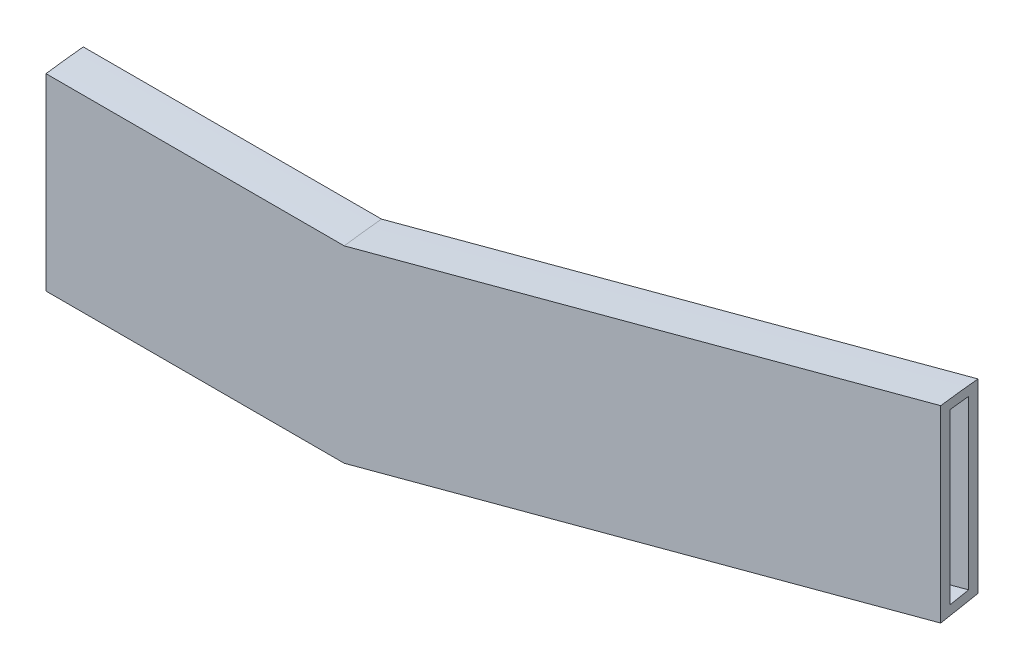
ISO-10303-21;
HEADER;
FILE_DESCRIPTION(('STEP AP214'),'2;1');
FILE_NAME('part.step','',(''),(''),'','','');
FILE_SCHEMA(('AUTOMOTIVE_DESIGN { 1 0 10303 214 1 1 1 1 }'));
ENDSEC;
DATA;
#1=APPLICATION_CONTEXT('core data for automotive mechanical design processes');
#2=APPLICATION_PROTOCOL_DEFINITION('international standard','automotive_design',2000,#1);
#3=PRODUCT_CONTEXT('',#1,'mechanical');
#4=PRODUCT('Part','Part','',(#3));
#5=PRODUCT_RELATED_PRODUCT_CATEGORY('part','',(#4));
#6=PRODUCT_DEFINITION_FORMATION('','',#4);
#7=PRODUCT_DEFINITION_CONTEXT('part definition',#1,'design');
#8=PRODUCT_DEFINITION('design','',#6,#7);
#9=PRODUCT_DEFINITION_SHAPE('','',#8);
#10=(LENGTH_UNIT() NAMED_UNIT(*) SI_UNIT(.MILLI.,.METRE.));
#11=(NAMED_UNIT(*) PLANE_ANGLE_UNIT() SI_UNIT($,.RADIAN.));
#12=(NAMED_UNIT(*) SI_UNIT($,.STERADIAN.) SOLID_ANGLE_UNIT());
#13=UNCERTAINTY_MEASURE_WITH_UNIT(LENGTH_MEASURE(1.E-05),#10,'distance_accuracy_value','');
#14=(GEOMETRIC_REPRESENTATION_CONTEXT(3) GLOBAL_UNCERTAINTY_ASSIGNED_CONTEXT((#13)) GLOBAL_UNIT_ASSIGNED_CONTEXT((#10,
#11,#12)) REPRESENTATION_CONTEXT('',''));
#15=CARTESIAN_POINT('',(0.,0.,0.));
#16=DIRECTION('',(0.,0.,1.));
#17=DIRECTION('',(1.,0.,0.));
#18=AXIS2_PLACEMENT_3D('',#15,#16,#17);
#19=CARTESIAN_POINT('',(0.,18.4337974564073,-34.1292068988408));
#20=DIRECTION('',(-1.,0.,0.));
#21=DIRECTION('',(0.,0.,1.));
#22=AXIS2_PLACEMENT_3D('',#19,#20,#21);
#23=PLANE('',#22);
#24=CARTESIAN_POINT('',(0.,18.6103708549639,-35.71875));
#25=CARTESIAN_POINT('',(0.,18.5040045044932,-34.6579138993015));
#26=CARTESIAN_POINT('',(0.,18.374784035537,-33.5991378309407));
#27=CARTESIAN_POINT('',(0.,18.2236431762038,-32.54375));
#28=B_SPLINE_CURVE_WITH_KNOTS('',3,(#24,#25,#26,#27),.UNSPECIFIED.,.F.,.F.,(4,4),
(0.370697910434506,0.381261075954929),.UNSPECIFIED.);
#29=CARTESIAN_POINT('',(0.,18.6103708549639,-35.71875));
#30=VERTEX_POINT('',#29);
#31=CARTESIAN_POINT('',(0.,18.2236431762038,-32.54375));
#32=VERTEX_POINT('',#31);
#33=EDGE_CURVE('E166',#30,#32,#28,.T.);
#34=ORIENTED_EDGE('',*,*,#33,.F.);
#35=DIRECTION('',(0.,1.,0.));
#36=VECTOR('',#35,1.);
#37=CARTESIAN_POINT('',(0.,18.6103708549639,-35.71875));
#38=LINE('',#37,#36);
#39=CARTESIAN_POINT('',(0.,2.78680767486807,-35.7187499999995));
#40=VERTEX_POINT('',#39);
#41=EDGE_CURVE('E77',#40,#30,#38,.T.);
#42=ORIENTED_EDGE('',*,*,#41,.F.);
#43=CARTESIAN_POINT('',(0.,2.18621440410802,-32.54375));
#44=CARTESIAN_POINT('',(0.,2.3872384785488,-33.6019266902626));
#45=CARTESIAN_POINT('',(0.,2.58767763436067,-34.6602152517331));
#46=CARTESIAN_POINT('',(0.,2.78680767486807,-35.7187499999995));
#47=B_SPLINE_CURVE_WITH_KNOTS('',3,(#43,#44,#45,#46),.UNSPECIFIED.,.F.,.F.,(4,4),
(0.623360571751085,0.633917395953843),.UNSPECIFIED.);
#48=CARTESIAN_POINT('',(0.,2.18621440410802,-32.54375));
#49=VERTEX_POINT('',#48);
#50=EDGE_CURVE('E339',#49,#40,#47,.T.);
#51=ORIENTED_EDGE('',*,*,#50,.F.);
#52=DIRECTION('',(0.,-1.,0.));
#53=VECTOR('',#52,1.);
#54=CARTESIAN_POINT('',(0.,18.2236431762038,-32.54375));
#55=LINE('',#54,#53);
#56=EDGE_CURVE('E340',#32,#49,#55,.T.);
#57=ORIENTED_EDGE('',*,*,#56,.F.);
#58=EDGE_LOOP('',(#34,#42,#51,#57));
#59=FACE_BOUND('',#58,.T.);
#60=DIRECTION('',(0.,1.,0.));
#61=VECTOR('',#60,1.);
#62=CARTESIAN_POINT('',(0.,17.7278042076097,-34.925));
#63=LINE('',#62,#61);
#64=CARTESIAN_POINT('',(0.,3.4449989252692,-34.9249999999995));
#65=VERTEX_POINT('',#64);
#66=CARTESIAN_POINT('',(0.,17.7278042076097,-34.925));
#67=VERTEX_POINT('',#66);
#68=EDGE_CURVE('E142',#65,#67,#63,.T.);
#69=ORIENTED_EDGE('',*,*,#68,.T.);
#70=CARTESIAN_POINT('',(0.,17.7278042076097,-34.925));
#71=CARTESIAN_POINT('',(0.,17.6683129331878,-34.3951658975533));
#72=CARTESIAN_POINT('',(0.,17.6031113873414,-33.8659429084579));
#73=CARTESIAN_POINT('',(0.,17.5323195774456,-33.3375));
#74=B_SPLINE_CURVE_WITH_KNOTS('',3,(#70,#71,#72,#73),.UNSPECIFIED.,.F.,.F.,(4,4),
(0.373628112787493,0.378966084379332),.UNSPECIFIED.);
#75=CARTESIAN_POINT('',(0.,17.5323195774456,-33.3375));
#76=VERTEX_POINT('',#75);
#77=EDGE_CURVE('E48',#67,#76,#74,.T.);
#78=ORIENTED_EDGE('',*,*,#77,.T.);
#79=DIRECTION('',(0.,-1.,0.));
#80=VECTOR('',#79,1.);
#81=CARTESIAN_POINT('',(0.,17.5323195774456,-33.3375));
#82=LINE('',#81,#80);
#83=CARTESIAN_POINT('',(0.,3.14477121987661,-33.3375000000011));
#84=VERTEX_POINT('',#83);
#85=EDGE_CURVE('E439',#76,#84,#82,.T.);
#86=ORIENTED_EDGE('',*,*,#85,.T.);
#87=CARTESIAN_POINT('',(0.,3.14477121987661,-33.3375000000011));
#88=CARTESIAN_POINT('',(0.,3.24507710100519,-33.8666231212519));
#89=CARTESIAN_POINT('',(0.,3.3451831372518,-34.3957842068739));
#90=CARTESIAN_POINT('',(0.,3.4449989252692,-34.9249999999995));
#91=B_SPLINE_CURVE_WITH_KNOTS('',3,(#87,#88,#89,#90),.UNSPECIFIED.,.F.,.F.,(4,4),
(0.626491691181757,0.631767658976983),.UNSPECIFIED.);
#92=EDGE_CURVE('E442',#84,#65,#91,.T.);
#93=ORIENTED_EDGE('',*,*,#92,.T.);
#94=EDGE_LOOP('',(#69,#78,#86,#93));
#95=FACE_BOUND('',#94,.T.);
#96=ADVANCED_FACE('F32',(#59,#95),#23,.T.);
#97=CARTESIAN_POINT('',(25.4,18.6103708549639,-35.71875));
#98=CARTESIAN_POINT('',(25.4,18.5040045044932,-34.6579138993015));
#99=CARTESIAN_POINT('',(25.4,18.374784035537,-33.5991378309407));
#100=CARTESIAN_POINT('',(25.4,18.2236431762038,-32.54375));
#101=B_SPLINE_CURVE_WITH_KNOTS('',3,(#97,#98,#99,#100),.UNSPECIFIED.,.F.,.F.,(4,4),
(0.370697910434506,0.381261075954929),.UNSPECIFIED.);
#102=DIRECTION('',(-1.,0.,0.));
#103=VECTOR('',#102,1.);
#104=SURFACE_OF_LINEAR_EXTRUSION('',#101,#103);
#105=ORIENTED_EDGE('',*,*,#33,.T.);
#106=DIRECTION('',(-1.,0.,0.));
#107=VECTOR('',#106,1.);
#108=CARTESIAN_POINT('',(25.4,18.2236431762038,-32.54375));
#109=LINE('',#108,#107);
#110=CARTESIAN_POINT('',(25.4,18.2236431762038,-32.54375));
#111=VERTEX_POINT('',#110);
#112=EDGE_CURVE('E11',#111,#32,#109,.T.);
#113=ORIENTED_EDGE('',*,*,#112,.F.);
#114=CARTESIAN_POINT('',(25.4,18.6103708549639,-35.71875));
#115=VERTEX_POINT('',#114);
#116=EDGE_CURVE('E167',#115,#111,#101,.T.);
#117=ORIENTED_EDGE('',*,*,#116,.F.);
#118=DIRECTION('',(-1.,0.,0.));
#119=VECTOR('',#118,1.);
#120=CARTESIAN_POINT('',(25.4,18.6103708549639,-35.71875));
#121=LINE('',#120,#119);
#122=EDGE_CURVE('E180',#115,#30,#121,.T.);
#123=ORIENTED_EDGE('',*,*,#122,.T.);
#124=EDGE_LOOP('',(#105,#113,#117,#123));
#125=FACE_BOUND('',#124,.T.);
#126=ADVANCED_FACE('F34',(#125),#104,.F.);
#127=CARTESIAN_POINT('',(25.4,18.2236431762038,-32.54375));
#128=DIRECTION('',(0.,0.,-1.));
#129=DIRECTION('',(-1.,0.,0.));
#130=AXIS2_PLACEMENT_3D('',#127,#128,#129);
#131=PLANE('',#130);
#132=ORIENTED_EDGE('',*,*,#56,.T.);
#133=DIRECTION('',(-1.,0.,0.));
#134=VECTOR('',#133,1.);
#135=CARTESIAN_POINT('',(25.4,2.18621440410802,-32.54375));
#136=LINE('',#135,#134);
#137=CARTESIAN_POINT('',(25.4,2.18621440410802,-32.54375));
#138=VERTEX_POINT('',#137);
#139=EDGE_CURVE('E41',#138,#49,#136,.T.);
#140=ORIENTED_EDGE('',*,*,#139,.F.);
#141=DIRECTION('',(0.965925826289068,0.258819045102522,0.));
#142=VECTOR('',#141,1.);
#143=CARTESIAN_POINT('',(25.4,2.18621440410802,-32.54375));
#144=LINE('',#143,#142);
#145=CARTESIAN_POINT('',(76.2,15.7980333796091,-32.54375));
#146=VERTEX_POINT('',#145);
#147=EDGE_CURVE('E323',#138,#146,#144,.T.);
#148=ORIENTED_EDGE('',*,*,#147,.T.);
#149=DIRECTION('',(0.,-1.,0.));
#150=VECTOR('',#149,1.);
#151=CARTESIAN_POINT('',(76.2,31.8354621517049,-32.54375));
#152=LINE('',#151,#150);
#153=CARTESIAN_POINT('',(76.2,31.8354621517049,-32.54375));
#154=VERTEX_POINT('',#153);
#155=EDGE_CURVE('E299',#154,#146,#152,.T.);
#156=ORIENTED_EDGE('',*,*,#155,.F.);
#157=DIRECTION('',(0.965925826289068,0.258819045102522,0.));
#158=VECTOR('',#157,1.);
#159=CARTESIAN_POINT('',(25.4,18.2236431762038,-32.54375));
#160=LINE('',#159,#158);
#161=EDGE_CURVE('E317',#111,#154,#160,.T.);
#162=ORIENTED_EDGE('',*,*,#161,.F.);
#163=ORIENTED_EDGE('',*,*,#112,.T.);
#164=EDGE_LOOP('',(#132,#140,#148,#156,#162,#163));
#165=FACE_BOUND('',#164,.T.);
#166=ADVANCED_FACE('F192',(#165),#131,.F.);
#167=CARTESIAN_POINT('',(25.4,2.18621440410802,-32.54375));
#168=CARTESIAN_POINT('',(25.4,2.3872384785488,-33.6019266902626));
#169=CARTESIAN_POINT('',(25.4,2.58767763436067,-34.6602152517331));
#170=CARTESIAN_POINT('',(25.4,2.78680767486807,-35.7187499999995));
#171=B_SPLINE_CURVE_WITH_KNOTS('',3,(#167,#168,#169,#170),.UNSPECIFIED.,.F.,.F.,(4,4),
(0.623360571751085,0.633917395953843),.UNSPECIFIED.);
#172=DIRECTION('',(-1.,0.,0.));
#173=VECTOR('',#172,1.);
#174=SURFACE_OF_LINEAR_EXTRUSION('',#171,#173);
#175=ORIENTED_EDGE('',*,*,#50,.T.);
#176=DIRECTION('',(-1.,0.,0.));
#177=VECTOR('',#176,1.);
#178=CARTESIAN_POINT('',(25.4,2.78680767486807,-35.7187499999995));
#179=LINE('',#178,#177);
#180=CARTESIAN_POINT('',(25.4,2.78680767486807,-35.7187499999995));
#181=VERTEX_POINT('',#180);
#182=EDGE_CURVE('E57',#181,#40,#179,.T.);
#183=ORIENTED_EDGE('',*,*,#182,.F.);
#184=EDGE_CURVE('E172',#138,#181,#171,.T.);
#185=ORIENTED_EDGE('',*,*,#184,.F.);
#186=ORIENTED_EDGE('',*,*,#139,.T.);
#187=EDGE_LOOP('',(#175,#183,#185,#186));
#188=FACE_BOUND('',#187,.T.);
#189=ADVANCED_FACE('F188',(#188),#174,.F.);
#190=CARTESIAN_POINT('',(25.4,18.6103708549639,-35.71875));
#191=DIRECTION('',(0.,0.,1.));
#192=DIRECTION('',(0.,-1.,0.));
#193=AXIS2_PLACEMENT_3D('',#190,#191,#192);
#194=PLANE('',#193);
#195=ORIENTED_EDGE('',*,*,#41,.T.);
#196=ORIENTED_EDGE('',*,*,#122,.F.);
#197=DIRECTION('',(0.965925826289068,0.258819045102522,0.));
#198=VECTOR('',#197,1.);
#199=CARTESIAN_POINT('',(25.4,18.6103708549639,-35.71875));
#200=LINE('',#199,#198);
#201=CARTESIAN_POINT('',(76.2,32.2221898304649,-35.71875));
#202=VERTEX_POINT('',#201);
#203=EDGE_CURVE('E324',#115,#202,#200,.T.);
#204=ORIENTED_EDGE('',*,*,#203,.T.);
#205=DIRECTION('',(0.,1.,0.));
#206=VECTOR('',#205,1.);
#207=CARTESIAN_POINT('',(76.2,16.3986266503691,-35.7187499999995));
#208=LINE('',#207,#206);
#209=CARTESIAN_POINT('',(76.2,16.3986266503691,-35.7187499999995));
#210=VERTEX_POINT('',#209);
#211=EDGE_CURVE('E152',#210,#202,#208,.T.);
#212=ORIENTED_EDGE('',*,*,#211,.F.);
#213=DIRECTION('',(0.965925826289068,0.258819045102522,0.));
#214=VECTOR('',#213,1.);
#215=CARTESIAN_POINT('',(25.4,2.78680767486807,-35.7187499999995));
#216=LINE('',#215,#214);
#217=EDGE_CURVE('E214',#181,#210,#216,.T.);
#218=ORIENTED_EDGE('',*,*,#217,.F.);
#219=ORIENTED_EDGE('',*,*,#182,.T.);
#220=EDGE_LOOP('',(#195,#196,#204,#212,#218,#219));
#221=FACE_BOUND('',#220,.T.);
#222=ADVANCED_FACE('F191',(#221),#194,.F.);
#223=CARTESIAN_POINT('',(25.4,17.7278042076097,-34.925));
#224=CARTESIAN_POINT('',(25.4,17.6683129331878,-34.3951658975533));
#225=CARTESIAN_POINT('',(25.4,17.6031113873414,-33.8659429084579));
#226=CARTESIAN_POINT('',(25.4,17.5323195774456,-33.3375));
#227=B_SPLINE_CURVE_WITH_KNOTS('',3,(#223,#224,#225,#226),.UNSPECIFIED.,.F.,.F.,(4,4),
(0.373628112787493,0.378966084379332),.UNSPECIFIED.);
#228=DIRECTION('',(-1.,0.,0.));
#229=VECTOR('',#228,1.);
#230=SURFACE_OF_LINEAR_EXTRUSION('',#227,#229);
#231=ORIENTED_EDGE('',*,*,#77,.F.);
#232=DIRECTION('',(-1.,0.,0.));
#233=VECTOR('',#232,1.);
#234=CARTESIAN_POINT('',(25.4,17.7278042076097,-34.925));
#235=LINE('',#234,#233);
#236=CARTESIAN_POINT('',(25.4,17.7278042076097,-34.925));
#237=VERTEX_POINT('',#236);
#238=EDGE_CURVE('E148',#237,#67,#235,.T.);
#239=ORIENTED_EDGE('',*,*,#238,.F.);
#240=CARTESIAN_POINT('',(25.4,17.5323195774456,-33.3375));
#241=VERTEX_POINT('',#240);
#242=EDGE_CURVE('E133',#237,#241,#227,.T.);
#243=ORIENTED_EDGE('',*,*,#242,.T.);
#244=DIRECTION('',(-1.,0.,0.));
#245=VECTOR('',#244,1.);
#246=CARTESIAN_POINT('',(25.4,17.5323195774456,-33.3375));
#247=LINE('',#246,#245);
#248=EDGE_CURVE('E165',#241,#76,#247,.T.);
#249=ORIENTED_EDGE('',*,*,#248,.T.);
#250=EDGE_LOOP('',(#231,#239,#243,#249));
#251=FACE_BOUND('',#250,.T.);
#252=ADVANCED_FACE('F154',(#251),#230,.T.);
#253=CARTESIAN_POINT('',(25.4,17.5323195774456,-33.3375));
#254=DIRECTION('',(0.,0.,-1.));
#255=DIRECTION('',(0.,1.,0.));
#256=AXIS2_PLACEMENT_3D('',#253,#254,#255);
#257=PLANE('',#256);
#258=ORIENTED_EDGE('',*,*,#85,.F.);
#259=ORIENTED_EDGE('',*,*,#248,.F.);
#260=DIRECTION('',(0.965925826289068,0.258819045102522,0.));
#261=VECTOR('',#260,1.);
#262=CARTESIAN_POINT('',(25.4,17.5323195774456,-33.3375));
#263=LINE('',#262,#261);
#264=CARTESIAN_POINT('',(76.2,31.1441385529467,-33.3375));
#265=VERTEX_POINT('',#264);
#266=EDGE_CURVE('E139',#241,#265,#263,.T.);
#267=ORIENTED_EDGE('',*,*,#266,.T.);
#268=DIRECTION('',(0.,-1.,0.));
#269=VECTOR('',#268,1.);
#270=CARTESIAN_POINT('',(76.2,31.1441385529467,-33.3375));
#271=LINE('',#270,#269);
#272=CARTESIAN_POINT('',(76.2,16.7565901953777,-33.3375000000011));
#273=VERTEX_POINT('',#272);
#274=EDGE_CURVE('E290',#273,#265,#271,.F.);
#275=ORIENTED_EDGE('',*,*,#274,.F.);
#276=DIRECTION('',(0.965925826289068,0.258819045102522,0.));
#277=VECTOR('',#276,1.);
#278=CARTESIAN_POINT('',(25.4,3.14477121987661,-33.3375000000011));
#279=LINE('',#278,#277);
#280=CARTESIAN_POINT('',(25.4,3.14477121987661,-33.3375000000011));
#281=VERTEX_POINT('',#280);
#282=EDGE_CURVE('E285',#281,#273,#279,.T.);
#283=ORIENTED_EDGE('',*,*,#282,.F.);
#284=DIRECTION('',(-1.,0.,0.));
#285=VECTOR('',#284,1.);
#286=CARTESIAN_POINT('',(25.4,3.14477121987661,-33.3375000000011));
#287=LINE('',#286,#285);
#288=EDGE_CURVE('E157',#281,#84,#287,.T.);
#289=ORIENTED_EDGE('',*,*,#288,.T.);
#290=EDGE_LOOP('',(#258,#259,#267,#275,#283,#289));
#291=FACE_BOUND('',#290,.T.);
#292=ADVANCED_FACE('F208',(#291),#257,.T.);
#293=CARTESIAN_POINT('',(25.4,3.14477121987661,-33.3375000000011));
#294=CARTESIAN_POINT('',(25.4,3.24507710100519,-33.8666231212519));
#295=CARTESIAN_POINT('',(25.4,3.3451831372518,-34.3957842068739));
#296=CARTESIAN_POINT('',(25.4,3.4449989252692,-34.9249999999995));
#297=B_SPLINE_CURVE_WITH_KNOTS('',3,(#293,#294,#295,#296),.UNSPECIFIED.,.F.,.F.,(4,4),
(0.626491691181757,0.631767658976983),.UNSPECIFIED.);
#298=DIRECTION('',(-1.,0.,0.));
#299=VECTOR('',#298,1.);
#300=SURFACE_OF_LINEAR_EXTRUSION('',#297,#299);
#301=ORIENTED_EDGE('',*,*,#92,.F.);
#302=ORIENTED_EDGE('',*,*,#288,.F.);
#303=CARTESIAN_POINT('',(25.4,3.44499892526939,-34.9249999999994));
#304=VERTEX_POINT('',#303);
#305=EDGE_CURVE('E141',#281,#304,#297,.T.);
#306=ORIENTED_EDGE('',*,*,#305,.T.);
#307=DIRECTION('',(-1.,0.,0.));
#308=VECTOR('',#307,1.);
#309=CARTESIAN_POINT('',(25.4,3.4449989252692,-34.9249999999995));
#310=LINE('',#309,#308);
#311=EDGE_CURVE('E155',#304,#65,#310,.T.);
#312=ORIENTED_EDGE('',*,*,#311,.T.);
#313=EDGE_LOOP('',(#301,#302,#306,#312));
#314=FACE_BOUND('',#313,.T.);
#315=ADVANCED_FACE('F229',(#314),#300,.T.);
#316=CARTESIAN_POINT('',(25.4,17.7278042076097,-34.925));
#317=DIRECTION('',(0.,0.,1.));
#318=DIRECTION('',(0.,-1.,0.));
#319=AXIS2_PLACEMENT_3D('',#316,#317,#318);
#320=PLANE('',#319);
#321=ORIENTED_EDGE('',*,*,#68,.F.);
#322=ORIENTED_EDGE('',*,*,#311,.F.);
#323=DIRECTION('',(0.965925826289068,0.258819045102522,0.));
#324=VECTOR('',#323,1.);
#325=CARTESIAN_POINT('',(25.4,3.44499892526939,-34.9249999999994));
#326=LINE('',#325,#324);
#327=CARTESIAN_POINT('',(76.2,17.0568179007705,-34.9249999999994));
#328=VERTEX_POINT('',#327);
#329=EDGE_CURVE('E293',#304,#328,#326,.T.);
#330=ORIENTED_EDGE('',*,*,#329,.T.);
#331=DIRECTION('',(0.,1.,0.));
#332=VECTOR('',#331,1.);
#333=CARTESIAN_POINT('',(76.2,17.0568179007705,-34.9249999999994));
#334=LINE('',#333,#332);
#335=CARTESIAN_POINT('',(76.2,31.3396231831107,-34.925));
#336=VERTEX_POINT('',#335);
#337=EDGE_CURVE('E151',#336,#328,#334,.F.);
#338=ORIENTED_EDGE('',*,*,#337,.F.);
#339=DIRECTION('',(0.965925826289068,0.258819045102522,0.));
#340=VECTOR('',#339,1.);
#341=CARTESIAN_POINT('',(25.4,17.7278042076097,-34.925));
#342=LINE('',#341,#340);
#343=EDGE_CURVE('E137',#237,#336,#342,.T.);
#344=ORIENTED_EDGE('',*,*,#343,.F.);
#345=ORIENTED_EDGE('',*,*,#238,.T.);
#346=EDGE_LOOP('',(#321,#322,#330,#338,#344,#345));
#347=FACE_BOUND('',#346,.T.);
#348=ADVANCED_FACE('F147',(#347),#320,.T.);
#349=CARTESIAN_POINT('',(25.4,18.6103708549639,-35.71875));
#350=CARTESIAN_POINT('',(76.2,32.2221898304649,-35.71875));
#351=CARTESIAN_POINT('',(25.4,18.5040045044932,-34.6579138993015));
#352=CARTESIAN_POINT('',(76.2,32.1158234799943,-34.6579138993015));
#353=CARTESIAN_POINT('',(25.4,18.374784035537,-33.5991378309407));
#354=CARTESIAN_POINT('',(76.2,31.9866030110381,-33.5991378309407));
#355=CARTESIAN_POINT('',(25.4,18.2236431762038,-32.54375));
#356=CARTESIAN_POINT('',(76.2,31.8354621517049,-32.54375));
#357=B_SPLINE_SURFACE_WITH_KNOTS('',3,1,((#349,#350),(#351,#352),(#353,#354),(#355,#356)),
.UNSPECIFIED.,.F.,.F.,.F.,(4,4),(2,2),(0.,1.),(0.,1.),.UNSPECIFIED.);
#358=CARTESIAN_POINT('',(76.2,32.2221898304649,-35.71875));
#359=CARTESIAN_POINT('',(76.2,32.1158234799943,-34.6579138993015));
#360=CARTESIAN_POINT('',(76.2,31.9866030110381,-33.5991378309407));
#361=CARTESIAN_POINT('',(76.2,31.8354621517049,-32.54375));
#362=B_SPLINE_CURVE_WITH_KNOTS('',3,(#358,#359,#360,#361),.UNSPECIFIED.,.F.,.F.,(4,4),
(0.370697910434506,0.381261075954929),.UNSPECIFIED.);
#363=EDGE_CURVE('E303',#202,#154,#362,.T.);
#364=ORIENTED_EDGE('',*,*,#161,.T.);
#365=ORIENTED_EDGE('',*,*,#363,.F.);
#366=ORIENTED_EDGE('',*,*,#203,.F.);
#367=ORIENTED_EDGE('',*,*,#116,.T.);
#368=EDGE_LOOP('',(#364,#365,#366,#367));
#369=FACE_BOUND('',#368,.T.);
#370=ADVANCED_FACE('F235',(#369),#357,.T.);
#371=CARTESIAN_POINT('',(25.4,2.18621440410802,-32.54375));
#372=CARTESIAN_POINT('',(76.2,15.7980333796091,-32.54375));
#373=CARTESIAN_POINT('',(25.4,2.3872384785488,-33.6019266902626));
#374=CARTESIAN_POINT('',(76.2,15.9990574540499,-33.6019266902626));
#375=CARTESIAN_POINT('',(25.4,2.58767763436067,-34.6602152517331));
#376=CARTESIAN_POINT('',(76.2,16.1994966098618,-34.6602152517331));
#377=CARTESIAN_POINT('',(25.4,2.78680767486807,-35.7187499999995));
#378=CARTESIAN_POINT('',(76.2,16.3986266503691,-35.7187499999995));
#379=B_SPLINE_SURFACE_WITH_KNOTS('',3,1,((#371,#372),(#373,#374),(#375,#376),(#377,#378)),
.UNSPECIFIED.,.F.,.F.,.F.,(4,4),(2,2),(0.,1.),(0.,1.),.UNSPECIFIED.);
#380=CARTESIAN_POINT('',(76.2,15.7980333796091,-32.54375));
#381=CARTESIAN_POINT('',(76.2,15.9990574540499,-33.6019266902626));
#382=CARTESIAN_POINT('',(76.2,16.1994966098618,-34.6602152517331));
#383=CARTESIAN_POINT('',(76.2,16.3986266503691,-35.7187499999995));
#384=B_SPLINE_CURVE_WITH_KNOTS('',3,(#380,#381,#382,#383),.UNSPECIFIED.,.F.,.F.,(4,4),
(0.623360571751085,0.633917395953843),.UNSPECIFIED.);
#385=EDGE_CURVE('E302',#146,#210,#384,.T.);
#386=ORIENTED_EDGE('',*,*,#217,.T.);
#387=ORIENTED_EDGE('',*,*,#385,.F.);
#388=ORIENTED_EDGE('',*,*,#147,.F.);
#389=ORIENTED_EDGE('',*,*,#184,.T.);
#390=EDGE_LOOP('',(#386,#387,#388,#389));
#391=FACE_BOUND('',#390,.T.);
#392=ADVANCED_FACE('F236',(#391),#379,.T.);
#393=CARTESIAN_POINT('',(76.2,32.0456164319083,-34.1292068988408));
#394=DIRECTION('',(-1.,0.,0.));
#395=DIRECTION('',(0.,0.,1.));
#396=AXIS2_PLACEMENT_3D('',#393,#394,#395);
#397=PLANE('',#396);
#398=ORIENTED_EDGE('',*,*,#363,.T.);
#399=ORIENTED_EDGE('',*,*,#155,.T.);
#400=ORIENTED_EDGE('',*,*,#385,.T.);
#401=ORIENTED_EDGE('',*,*,#211,.T.);
#402=EDGE_LOOP('',(#398,#399,#400,#401));
#403=FACE_BOUND('',#402,.T.);
#404=CARTESIAN_POINT('',(76.2,-43.0936517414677,-43.2849218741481));
#405=DIRECTION('',(1.,0.,0.));
#406=DIRECTION('',(0.,0.,-1.));
#407=AXIS2_PLACEMENT_3D('',#404,#405,#406);
#408=CIRCLE('',#407,74.9012730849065);
#409=EDGE_CURVE('E297',#265,#336,#408,.F.);
#410=ORIENTED_EDGE('',*,*,#409,.T.);
#411=ORIENTED_EDGE('',*,*,#337,.T.);
#412=CARTESIAN_POINT('',(76.2,-1697.16872268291,-358.296876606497));
#413=DIRECTION('',(-1.,0.,0.));
#414=DIRECTION('',(0.,0.,-1.));
#415=AXIS2_PLACEMENT_3D('',#412,#413,#414);
#416=CIRCLE('',#415,1744.4593932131);
#417=EDGE_CURVE('E286',#328,#273,#416,.F.);
#418=ORIENTED_EDGE('',*,*,#417,.T.);
#419=ORIENTED_EDGE('',*,*,#274,.T.);
#420=EDGE_LOOP('',(#410,#411,#418,#419));
#421=FACE_BOUND('',#420,.T.);
#422=ADVANCED_FACE('F241',(#403,#421),#397,.F.);
#423=CARTESIAN_POINT('',(25.4,3.44499892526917,-34.9249999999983));
#424=CARTESIAN_POINT('',(76.2,17.0568179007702,-34.9249999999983));
#425=CARTESIAN_POINT('',(25.4,3.34516807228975,-34.3957870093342));
#426=CARTESIAN_POINT('',(76.2,16.9569870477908,-34.3957870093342));
#427=CARTESIAN_POINT('',(25.4,3.24509216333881,-33.8666203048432));
#428=CARTESIAN_POINT('',(76.2,16.8569111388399,-33.8666203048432));
#429=CARTESIAN_POINT('',(25.4,3.14477121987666,-33.3375000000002));
#430=CARTESIAN_POINT('',(76.2,16.7565901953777,-33.3375000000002));
#431=(BOUNDED_SURFACE() B_SPLINE_SURFACE(3,1,((#423,#424),(#425,#426),(#427,#428),(#429,#430)),
.UNSPECIFIED.,.F.,.F.,.F.) B_SPLINE_SURFACE_WITH_KNOTS((4,4),(2,2),(0.,1.),(0.,1.),
.UNSPECIFIED.) GEOMETRIC_REPRESENTATION_ITEM() RATIONAL_B_SPLINE_SURFACE(((1.,1.),
(0.999999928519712,0.999999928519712),(0.999999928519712,0.999999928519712),(1.,1.))) REPRESENTATION_ITEM('') SURFACE());
#432=ORIENTED_EDGE('',*,*,#282,.T.);
#433=ORIENTED_EDGE('',*,*,#417,.F.);
#434=ORIENTED_EDGE('',*,*,#329,.F.);
#435=ORIENTED_EDGE('',*,*,#305,.F.);
#436=EDGE_LOOP('',(#432,#433,#434,#435));
#437=FACE_BOUND('',#436,.T.);
#438=ADVANCED_FACE('F260',(#437),#431,.T.);
#439=CARTESIAN_POINT('',(25.4,17.5323195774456,-33.3375));
#440=CARTESIAN_POINT('',(76.2,31.1441385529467,-33.3375));
#441=CARTESIAN_POINT('',(25.4,17.6031301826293,-33.8659608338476));
#442=CARTESIAN_POINT('',(76.2,31.2149491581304,-33.8659608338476));
#443=CARTESIAN_POINT('',(25.4,17.6682942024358,-34.3951476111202));
#444=CARTESIAN_POINT('',(76.2,31.2801131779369,-34.3951476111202));
#445=CARTESIAN_POINT('',(25.4,17.7278042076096,-34.925));
#446=CARTESIAN_POINT('',(76.2,31.3396231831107,-34.925));
#447=(BOUNDED_SURFACE() B_SPLINE_SURFACE(3,1,((#439,#440),(#441,#442),(#443,#444),(#445,#446)),
.UNSPECIFIED.,.F.,.F.,.F.) B_SPLINE_SURFACE_WITH_KNOTS((4,4),(2,2),(0.,1.),(0.,1.),
.UNSPECIFIED.) GEOMETRIC_REPRESENTATION_ITEM() RATIONAL_B_SPLINE_SURFACE(((1.,1.),
(0.999961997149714,0.999961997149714),(0.999961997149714,0.999961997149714),(1.,1.))) REPRESENTATION_ITEM('') SURFACE());
#448=ORIENTED_EDGE('',*,*,#409,.F.);
#449=ORIENTED_EDGE('',*,*,#266,.F.);
#450=ORIENTED_EDGE('',*,*,#242,.F.);
#451=ORIENTED_EDGE('',*,*,#343,.T.);
#452=EDGE_LOOP('',(#448,#449,#450,#451));
#453=FACE_BOUND('',#452,.T.);
#454=ADVANCED_FACE('F136',(#453),#447,.T.);
#455=CLOSED_SHELL('',(#96,#126,#166,#189,#222,#252,#292,#315,#348,#370,#392,#422,#438,#454));
#456=MANIFOLD_SOLID_BREP('B2',#455);
#457=ADVANCED_BREP_SHAPE_REPRESENTATION('',(#18,#456),#14);
#458=SHAPE_DEFINITION_REPRESENTATION(#9,#457);
ENDSEC;
END-ISO-10303-21;
